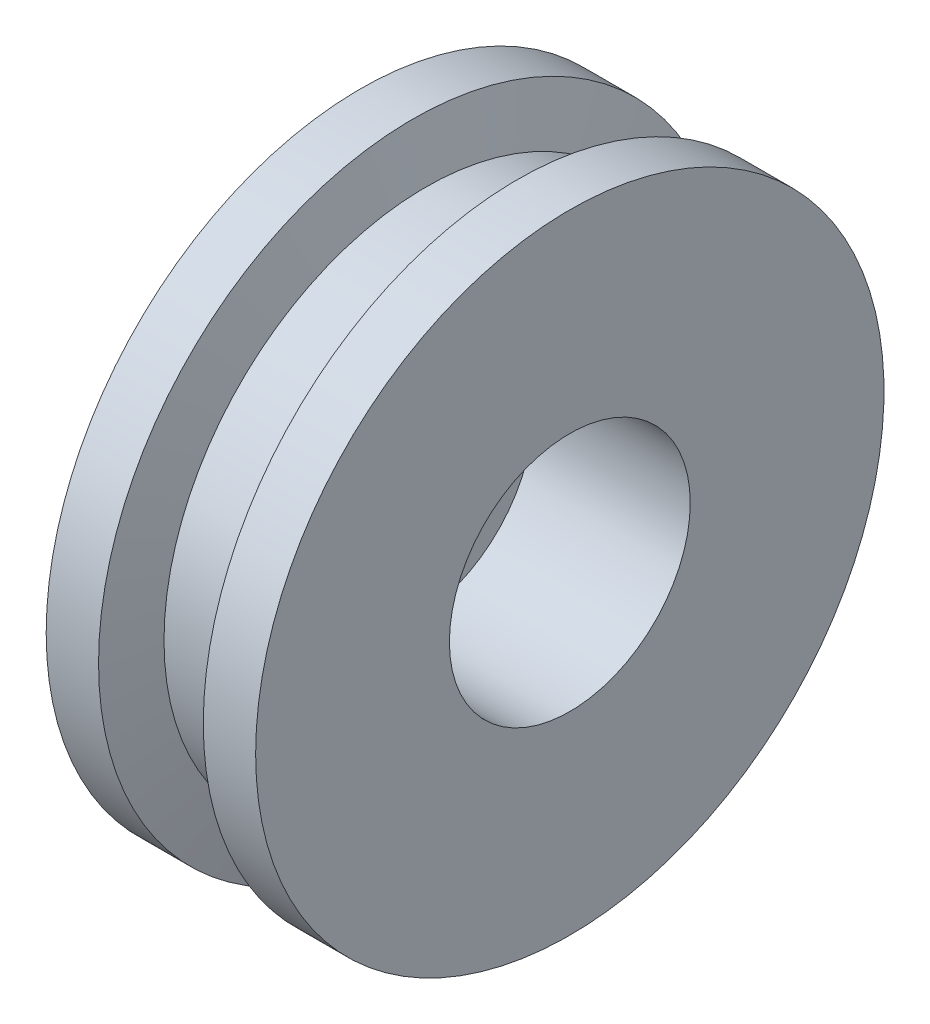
from build123d import *

# Parameters (mm, degrees)
ESQUISSE3_R             = 4.6
ENL_V_MAT_EXTRU_2_DEPTH = 6
ESQUISSE5_R             = 3
ENL_V_MAT_EXTRU_3_DEPTH = 8


with BuildPart() as part:
    # Esquisse1 → R_volution1 (revolve)
    with BuildSketch(Plane.XY, mode=Mode.PRIVATE) as r_volution1_sk:
        Polygon((-2, 12), (-1.5, 10), (1.5, 10), (2, 12), (4, 12), (4, 0), (-4, 0), (-4, 12), align=None)
    revolve(r_volution1_sk.sketch.rotate(Axis((-12.963264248, 0, 0), (1, 0, 0)), 90), axis=Axis((-12.963264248, 0, 0), (1, 0, 0)))

    # Esquisse3 → Enl_v. mat.-Extru.2 (cut)
    with BuildSketch(Plane(origin=(4, 0, 0), x_dir=(0, 0, -1), z_dir=(1, 0, 0))):
        Circle(ESQUISSE3_R)
    extrude(amount=-ENL_V_MAT_EXTRU_2_DEPTH, mode=Mode.SUBTRACT)

    # Esquisse5 → Enl_v. mat.-Extru.3 (cut)
    with BuildSketch(Plane.ZY.offset(4)):
        with Locations((-0.000860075, 0)):
            Circle(ESQUISSE5_R)
    extrude(amount=-ENL_V_MAT_EXTRU_3_DEPTH, mode=Mode.SUBTRACT)


solid = part.part
